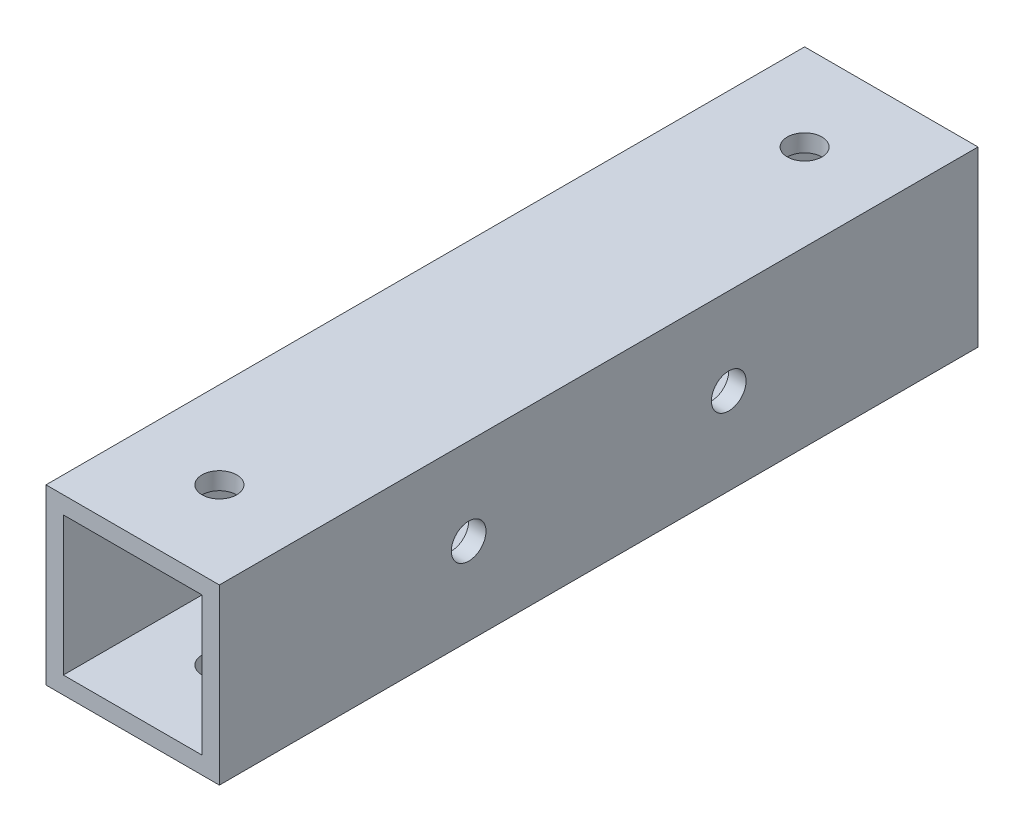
from build123d import *

# Parameters (mm, degrees)
SKETCH_1_W            = 20
SKETCH_1_H            = 20
SKETCH_1_W_2          = 16
SKETCH_1_H_2          = 16
EXTRUDE_1_DEPTH       = 87.5
HOLE_WIZARD_4_0_4_1_D = 4
HOLE_WIZARD_4_0_4_2_D = 4


with BuildPart() as part:
    # Sketch 1 → Extrude 1 (new body)
    with BuildSketch(Plane.XY):
        Rectangle(SKETCH_1_W, SKETCH_1_H)
        Rectangle(SKETCH_1_W_2, SKETCH_1_H_2, mode=Mode.SUBTRACT)
    extrude(amount=EXTRUDE_1_DEPTH)

    # Hole Wizard 4.0 _4_ _1 (through all)
    with Locations(Plane(origin=(0, 10, 0), x_dir=(1, 0, 0), z_dir=(0, 1, 0))):
        with Locations((0, -10), (0, -77.5)):
            Hole(HOLE_WIZARD_4_0_4_1_D / 2)

    # Hole Wizard 4.0 _4_ _2 (through all)
    with Locations(Plane(origin=(10, 0, 0), x_dir=(0, 0, -1), z_dir=(1, 0, 0))):
        with Locations((-58.75, 0), (-28.75, 0)):
            Hole(HOLE_WIZARD_4_0_4_2_D / 2)


solid = part.part
